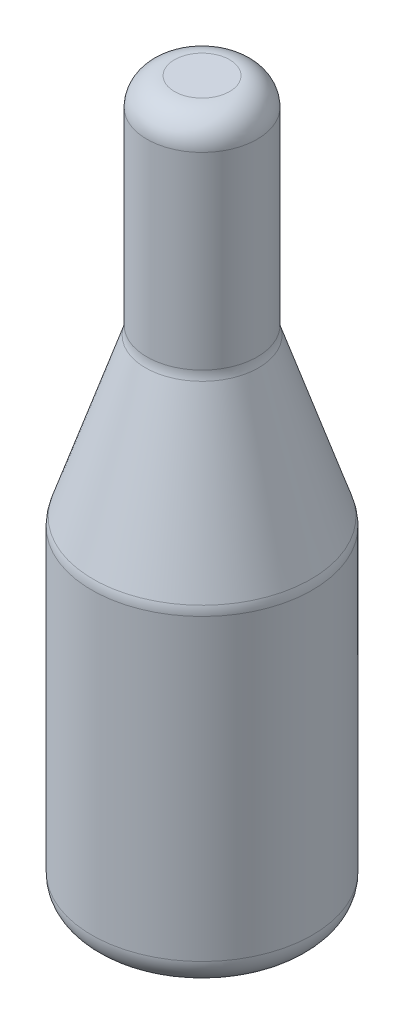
ISO-10303-21;
HEADER;
FILE_DESCRIPTION(('STEP AP214'),'2;1');
FILE_NAME('part.step','',(''),(''),'','','');
FILE_SCHEMA(('AUTOMOTIVE_DESIGN { 1 0 10303 214 1 1 1 1 }'));
ENDSEC;
DATA;
#1=APPLICATION_CONTEXT('core data for automotive mechanical design processes');
#2=APPLICATION_PROTOCOL_DEFINITION('international standard','automotive_design',2000,#1);
#3=PRODUCT_CONTEXT('',#1,'mechanical');
#4=PRODUCT('Part','Part','',(#3));
#5=PRODUCT_RELATED_PRODUCT_CATEGORY('part','',(#4));
#6=PRODUCT_DEFINITION_FORMATION('','',#4);
#7=PRODUCT_DEFINITION_CONTEXT('part definition',#1,'design');
#8=PRODUCT_DEFINITION('design','',#6,#7);
#9=PRODUCT_DEFINITION_SHAPE('','',#8);
#10=(LENGTH_UNIT() NAMED_UNIT(*) SI_UNIT(.MILLI.,.METRE.));
#11=(NAMED_UNIT(*) PLANE_ANGLE_UNIT() SI_UNIT($,.RADIAN.));
#12=(NAMED_UNIT(*) SI_UNIT($,.STERADIAN.) SOLID_ANGLE_UNIT());
#13=UNCERTAINTY_MEASURE_WITH_UNIT(LENGTH_MEASURE(1.E-05),#10,'distance_accuracy_value','');
#14=(GEOMETRIC_REPRESENTATION_CONTEXT(3) GLOBAL_UNCERTAINTY_ASSIGNED_CONTEXT((#13)) GLOBAL_UNIT_ASSIGNED_CONTEXT((#10,
#11,#12)) REPRESENTATION_CONTEXT('',''));
#15=CARTESIAN_POINT('',(0.,0.,0.));
#16=DIRECTION('',(0.,0.,1.));
#17=DIRECTION('',(1.,0.,0.));
#18=AXIS2_PLACEMENT_3D('',#15,#16,#17);
#19=CARTESIAN_POINT('',(49.9999999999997,1300.,0.));
#20=DIRECTION('',(0.,1.,0.));
#21=DIRECTION('',(0.,0.,1.));
#22=AXIS2_PLACEMENT_3D('',#19,#20,#21);
#23=PLANE('',#22);
#24=CARTESIAN_POINT('',(0.,1300.,0.));
#25=DIRECTION('',(0.,-1.,0.));
#26=DIRECTION('',(0.,0.,-1.));
#27=AXIS2_PLACEMENT_3D('',#24,#25,#26);
#28=CIRCLE('',#27,49.9999999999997);
#29=CARTESIAN_POINT('',(0.,1300.,-49.9999999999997));
#30=VERTEX_POINT('',#29);
#31=EDGE_CURVE('E10',#30,#30,#28,.T.);
#32=ORIENTED_EDGE('',*,*,#31,.F.);
#33=EDGE_LOOP('',(#32));
#34=FACE_BOUND('',#33,.T.);
#35=ADVANCED_FACE('F31',(#34),#23,.T.);
#36=CARTESIAN_POINT('',(0.,1250.,0.));
#37=DIRECTION('',(0.,-1.,0.));
#38=DIRECTION('',(0.,0.,-1.));
#39=AXIS2_PLACEMENT_3D('',#36,#37,#38);
#40=TOROIDAL_SURFACE('',#39,50.,50.);
#41=ORIENTED_EDGE('',*,*,#31,.T.);
#42=EDGE_LOOP('',(#41));
#43=FACE_BOUND('',#42,.T.);
#44=CARTESIAN_POINT('',(0.,1250.,0.));
#45=DIRECTION('',(0.,-1.,0.));
#46=DIRECTION('',(0.,0.,-1.));
#47=AXIS2_PLACEMENT_3D('',#44,#45,#46);
#48=CIRCLE('',#47,100.);
#49=CARTESIAN_POINT('',(0.,1250.,-100.));
#50=VERTEX_POINT('',#49);
#51=EDGE_CURVE('E37',#50,#50,#48,.T.);
#52=ORIENTED_EDGE('',*,*,#51,.F.);
#53=EDGE_LOOP('',(#52));
#54=FACE_BOUND('',#53,.T.);
#55=ADVANCED_FACE('F79',(#43,#54),#40,.T.);
#56=CARTESIAN_POINT('',(0.,0.,0.));
#57=DIRECTION('',(0.,-1.,0.));
#58=DIRECTION('',(0.,0.,-1.));
#59=AXIS2_PLACEMENT_3D('',#56,#57,#58);
#60=CYLINDRICAL_SURFACE('',#59,100.);
#61=ORIENTED_EDGE('',*,*,#51,.T.);
#62=EDGE_LOOP('',(#61));
#63=FACE_BOUND('',#62,.T.);
#64=CARTESIAN_POINT('',(0.,908.113883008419,0.));
#65=DIRECTION('',(0.,-1.,0.));
#66=DIRECTION('',(0.,0.,-1.));
#67=AXIS2_PLACEMENT_3D('',#64,#65,#66);
#68=CIRCLE('',#67,100.);
#69=CARTESIAN_POINT('',(0.,908.113883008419,-100.));
#70=VERTEX_POINT('',#69);
#71=EDGE_CURVE('E41',#70,#70,#68,.T.);
#72=ORIENTED_EDGE('',*,*,#71,.F.);
#73=EDGE_LOOP('',(#72));
#74=FACE_BOUND('',#73,.T.);
#75=ADVANCED_FACE('F84',(#63,#74),#60,.T.);
#76=CARTESIAN_POINT('',(0.,908.113883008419,0.));
#77=DIRECTION('',(0.,-1.,0.));
#78=DIRECTION('',(0.,0.,-1.));
#79=AXIS2_PLACEMENT_3D('',#76,#77,#78);
#80=TOROIDAL_SURFACE('',#79,150.,50.);
#81=ORIENTED_EDGE('',*,*,#71,.T.);
#82=EDGE_LOOP('',(#81));
#83=FACE_BOUND('',#82,.T.);
#84=CARTESIAN_POINT('',(0.,892.302494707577,0.));
#85=DIRECTION('',(0.,-1.,0.));
#86=DIRECTION('',(0.,0.,-1.));
#87=AXIS2_PLACEMENT_3D('',#84,#85,#86);
#88=CIRCLE('',#87,102.565835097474);
#89=CARTESIAN_POINT('',(0.,892.302494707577,-102.565835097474));
#90=VERTEX_POINT('',#89);
#91=EDGE_CURVE('E45',#90,#90,#88,.T.);
#92=ORIENTED_EDGE('',*,*,#91,.F.);
#93=EDGE_LOOP('',(#92));
#94=FACE_BOUND('',#93,.T.);
#95=ADVANCED_FACE('F88',(#83,#94),#80,.F.);
#96=CARTESIAN_POINT('',(0.,607.697505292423,0.));
#97=DIRECTION('',(0.,-1.,0.));
#98=DIRECTION('',(0.,0.,-1.));
#99=AXIS2_PLACEMENT_3D('',#96,#97,#98);
#100=CONICAL_SURFACE('',#99,197.434164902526,0.321750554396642);
#101=ORIENTED_EDGE('',*,*,#91,.T.);
#102=EDGE_LOOP('',(#101));
#103=FACE_BOUND('',#102,.T.);
#104=CARTESIAN_POINT('',(0.,607.697505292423,0.));
#105=DIRECTION('',(0.,-1.,0.));
#106=DIRECTION('',(0.,0.,-1.));
#107=AXIS2_PLACEMENT_3D('',#104,#105,#106);
#108=CIRCLE('',#107,197.434164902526);
#109=CARTESIAN_POINT('',(0.,607.697505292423,-197.434164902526));
#110=VERTEX_POINT('',#109);
#111=EDGE_CURVE('E50',#110,#110,#108,.T.);
#112=ORIENTED_EDGE('',*,*,#111,.F.);
#113=EDGE_LOOP('',(#112));
#114=FACE_BOUND('',#113,.T.);
#115=ADVANCED_FACE('F94',(#103,#114),#100,.T.);
#116=CARTESIAN_POINT('',(0.,591.886116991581,0.));
#117=DIRECTION('',(0.,-1.,0.));
#118=DIRECTION('',(0.,0.,-1.));
#119=AXIS2_PLACEMENT_3D('',#116,#117,#118);
#120=TOROIDAL_SURFACE('',#119,150.,50.);
#121=ORIENTED_EDGE('',*,*,#111,.T.);
#122=EDGE_LOOP('',(#121));
#123=FACE_BOUND('',#122,.T.);
#124=CARTESIAN_POINT('',(0.,591.886116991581,0.));
#125=DIRECTION('',(0.,-1.,0.));
#126=DIRECTION('',(0.,0.,-1.));
#127=AXIS2_PLACEMENT_3D('',#124,#125,#126);
#128=CIRCLE('',#127,200.);
#129=CARTESIAN_POINT('',(0.,591.886116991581,-200.));
#130=VERTEX_POINT('',#129);
#131=EDGE_CURVE('E53',#130,#130,#128,.T.);
#132=ORIENTED_EDGE('',*,*,#131,.F.);
#133=EDGE_LOOP('',(#132));
#134=FACE_BOUND('',#133,.T.);
#135=ADVANCED_FACE('F75',(#123,#134),#120,.T.);
#136=CARTESIAN_POINT('',(0.,0.,0.));
#137=DIRECTION('',(0.,-1.,0.));
#138=DIRECTION('',(0.,0.,-1.));
#139=AXIS2_PLACEMENT_3D('',#136,#137,#138);
#140=CYLINDRICAL_SURFACE('',#139,200.);
#141=ORIENTED_EDGE('',*,*,#131,.T.);
#142=EDGE_LOOP('',(#141));
#143=FACE_BOUND('',#142,.T.);
#144=CARTESIAN_POINT('',(0.,50.0000000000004,0.));
#145=DIRECTION('',(0.,-1.,0.));
#146=DIRECTION('',(0.,0.,-1.));
#147=AXIS2_PLACEMENT_3D('',#144,#145,#146);
#148=CIRCLE('',#147,200.);
#149=CARTESIAN_POINT('',(0.,50.0000000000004,-200.));
#150=VERTEX_POINT('',#149);
#151=EDGE_CURVE('E56',#150,#150,#148,.T.);
#152=ORIENTED_EDGE('',*,*,#151,.F.);
#153=EDGE_LOOP('',(#152));
#154=FACE_BOUND('',#153,.T.);
#155=ADVANCED_FACE('F67',(#143,#154),#140,.T.);
#156=CARTESIAN_POINT('',(0.,50.,0.));
#157=DIRECTION('',(0.,-1.,0.));
#158=DIRECTION('',(0.,0.,-1.));
#159=AXIS2_PLACEMENT_3D('',#156,#157,#158);
#160=TOROIDAL_SURFACE('',#159,150.,50.);
#161=ORIENTED_EDGE('',*,*,#151,.T.);
#162=EDGE_LOOP('',(#161));
#163=FACE_BOUND('',#162,.T.);
#164=CARTESIAN_POINT('',(0.,0.,0.));
#165=DIRECTION('',(0.,-1.,0.));
#166=DIRECTION('',(0.,0.,-1.));
#167=AXIS2_PLACEMENT_3D('',#164,#165,#166);
#168=CIRCLE('',#167,150.);
#169=CARTESIAN_POINT('',(0.,0.,-150.));
#170=VERTEX_POINT('',#169);
#171=EDGE_CURVE('E59',#170,#170,#168,.T.);
#172=ORIENTED_EDGE('',*,*,#171,.F.);
#173=EDGE_LOOP('',(#172));
#174=FACE_BOUND('',#173,.T.);
#175=ADVANCED_FACE('F65',(#163,#174),#160,.T.);
#176=CARTESIAN_POINT('',(0.,0.,0.));
#177=DIRECTION('',(0.,-1.,0.));
#178=DIRECTION('',(0.,0.,-1.));
#179=AXIS2_PLACEMENT_3D('',#176,#177,#178);
#180=PLANE('',#179);
#181=ORIENTED_EDGE('',*,*,#171,.T.);
#182=EDGE_LOOP('',(#181));
#183=FACE_BOUND('',#182,.T.);
#184=ADVANCED_FACE('F63',(#183),#180,.T.);
#185=CLOSED_SHELL('',(#35,#55,#75,#95,#115,#135,#155,#175,#184));
#186=MANIFOLD_SOLID_BREP('B2',#185);
#187=ADVANCED_BREP_SHAPE_REPRESENTATION('',(#18,#186),#14);
#188=SHAPE_DEFINITION_REPRESENTATION(#9,#187);
ENDSEC;
END-ISO-10303-21;
